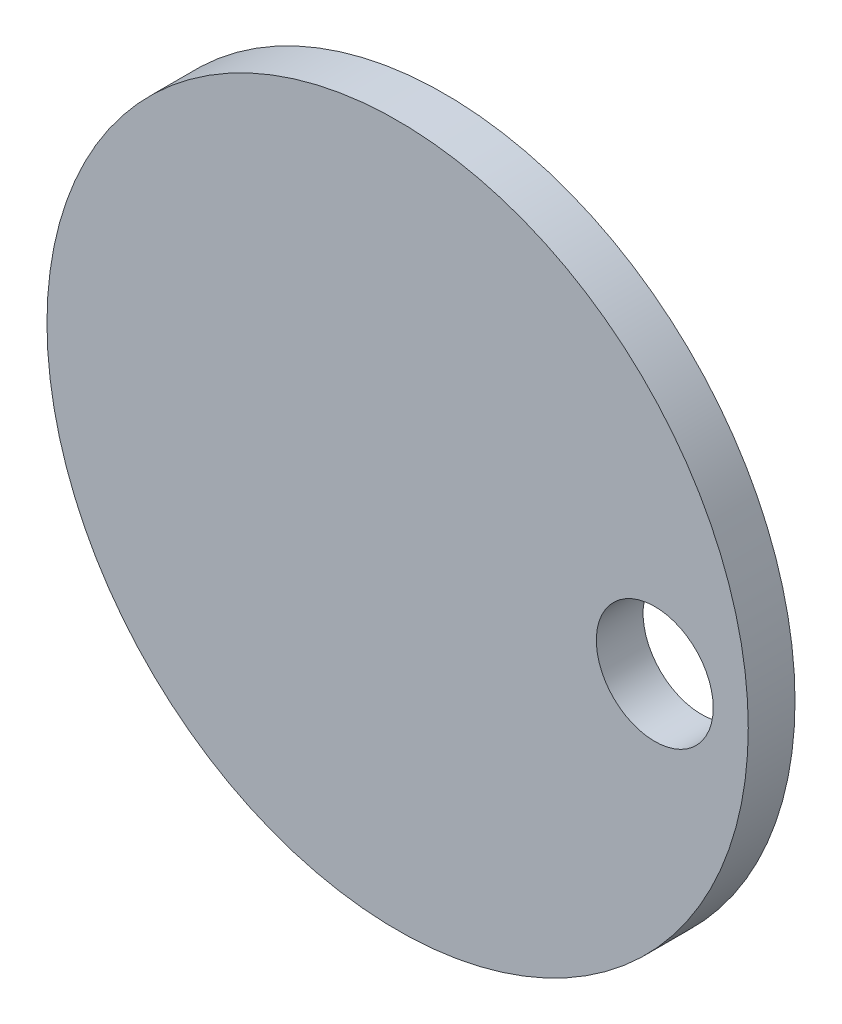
from build123d import *

# Parameters (mm, degrees)
SKIZZE1_R               = 15
SKIZZE1_R_2             = 2.5
LINEAR_AUSTRAGEN1_DEPTH = 2


with BuildPart() as part:
    # Skizze1 → Linear austragen1 (new body)
    with BuildSketch(Plane.XY):
        Circle(SKIZZE1_R)
        with Locations((11, 0)):
            Circle(SKIZZE1_R_2, mode=Mode.SUBTRACT)
    extrude(amount=LINEAR_AUSTRAGEN1_DEPTH)


solid = part.part
